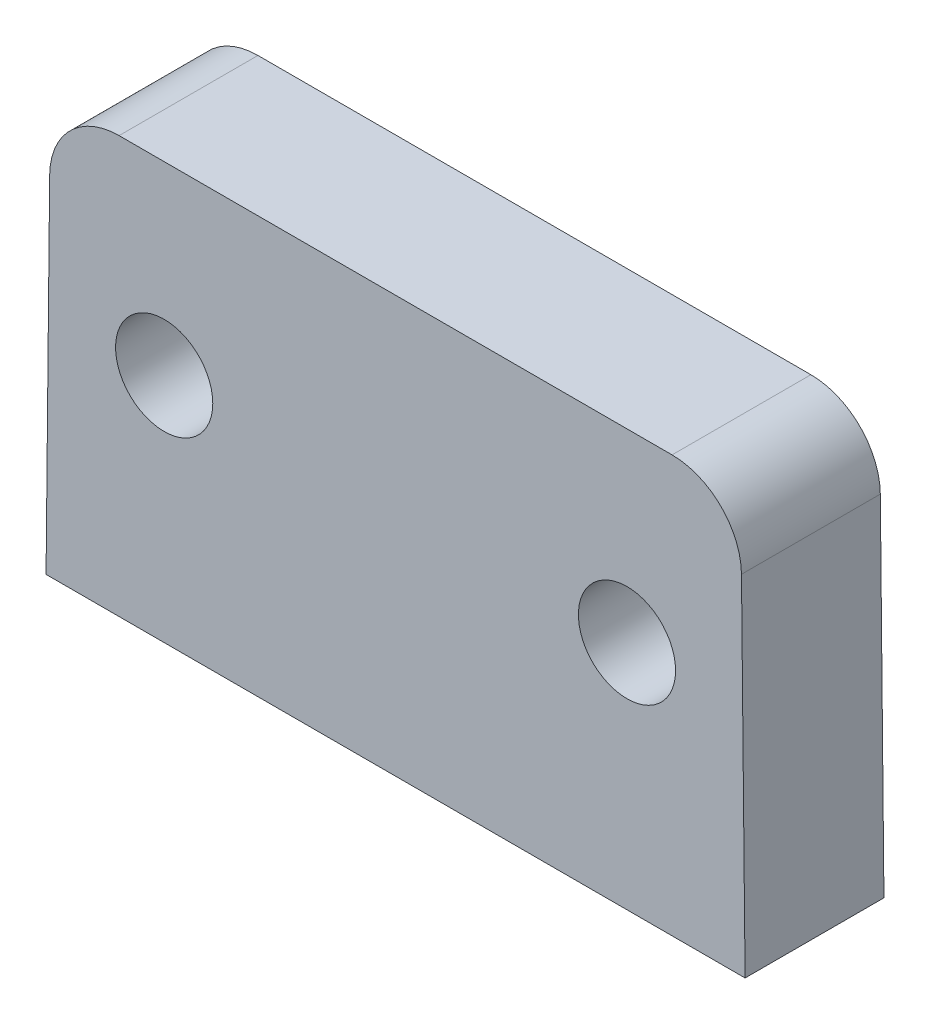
ISO-10303-21;
HEADER;
FILE_DESCRIPTION(('STEP AP214'),'2;1');
FILE_NAME('part.step','',(''),(''),'','','');
FILE_SCHEMA(('AUTOMOTIVE_DESIGN { 1 0 10303 214 1 1 1 1 }'));
ENDSEC;
DATA;
#1=APPLICATION_CONTEXT('core data for automotive mechanical design processes');
#2=APPLICATION_PROTOCOL_DEFINITION('international standard','automotive_design',2000,#1);
#3=PRODUCT_CONTEXT('',#1,'mechanical');
#4=PRODUCT('Part','Part','',(#3));
#5=PRODUCT_RELATED_PRODUCT_CATEGORY('part','',(#4));
#6=PRODUCT_DEFINITION_FORMATION('','',#4);
#7=PRODUCT_DEFINITION_CONTEXT('part definition',#1,'design');
#8=PRODUCT_DEFINITION('design','',#6,#7);
#9=PRODUCT_DEFINITION_SHAPE('','',#8);
#10=(LENGTH_UNIT() NAMED_UNIT(*) SI_UNIT(.MILLI.,.METRE.));
#11=(NAMED_UNIT(*) PLANE_ANGLE_UNIT() SI_UNIT($,.RADIAN.));
#12=(NAMED_UNIT(*) SI_UNIT($,.STERADIAN.) SOLID_ANGLE_UNIT());
#13=UNCERTAINTY_MEASURE_WITH_UNIT(LENGTH_MEASURE(1.E-05),#10,'distance_accuracy_value','');
#14=(GEOMETRIC_REPRESENTATION_CONTEXT(3) GLOBAL_UNCERTAINTY_ASSIGNED_CONTEXT((#13)) GLOBAL_UNIT_ASSIGNED_CONTEXT((#10,
#11,#12)) REPRESENTATION_CONTEXT('',''));
#15=CARTESIAN_POINT('',(0.,0.,0.));
#16=DIRECTION('',(0.,0.,1.));
#17=DIRECTION('',(1.,0.,0.));
#18=AXIS2_PLACEMENT_3D('',#15,#16,#17);
#19=CARTESIAN_POINT('',(3.15607429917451,15.,6.));
#20=DIRECTION('',(0.,0.,-1.));
#21=DIRECTION('',(-1.,0.,0.));
#22=AXIS2_PLACEMENT_3D('',#19,#20,#21);
#23=PLANE('',#22);
#24=DIRECTION('',(-0.0103935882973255,-0.999945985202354,0.));
#25=VECTOR('',#24,1.);
#26=CARTESIAN_POINT('',(0.,0.,6.));
#27=LINE('',#26,#25);
#28=CARTESIAN_POINT('',(0.156236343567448,15.031180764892,6.));
#29=VERTEX_POINT('',#28);
#30=CARTESIAN_POINT('',(0.,0.,6.));
#31=VERTEX_POINT('',#30);
#32=EDGE_CURVE('E130',#29,#31,#27,.T.);
#33=ORIENTED_EDGE('',*,*,#32,.T.);
#34=DIRECTION('',(1.,0.,0.));
#35=VECTOR('',#34,1.);
#36=CARTESIAN_POINT('',(0.,0.,6.));
#37=LINE('',#36,#35);
#38=CARTESIAN_POINT('',(30.2084231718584,0.,6.));
#39=VERTEX_POINT('',#38);
#40=EDGE_CURVE('E88',#31,#39,#37,.T.);
#41=ORIENTED_EDGE('',*,*,#40,.T.);
#42=DIRECTION('',(-0.0103935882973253,0.999945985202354,0.));
#43=VECTOR('',#42,1.);
#44=CARTESIAN_POINT('',(30.2084231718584,0.,6.));
#45=LINE('',#44,#43);
#46=CARTESIAN_POINT('',(30.052186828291,15.031180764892,6.));
#47=VERTEX_POINT('',#46);
#48=EDGE_CURVE('E101',#39,#47,#45,.T.);
#49=ORIENTED_EDGE('',*,*,#48,.T.);
#50=CARTESIAN_POINT('',(27.0523488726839,15.,6.));
#51=DIRECTION('',(0.,0.,1.));
#52=DIRECTION('',(1.,0.,0.));
#53=AXIS2_PLACEMENT_3D('',#50,#51,#52);
#54=CIRCLE('',#53,3.);
#55=CARTESIAN_POINT('',(27.0523488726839,18.,6.));
#56=VERTEX_POINT('',#55);
#57=EDGE_CURVE('E95',#47,#56,#54,.T.);
#58=ORIENTED_EDGE('',*,*,#57,.T.);
#59=DIRECTION('',(-1.,0.,0.));
#60=VECTOR('',#59,1.);
#61=CARTESIAN_POINT('',(3.15607429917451,18.,6.));
#62=LINE('',#61,#60);
#63=CARTESIAN_POINT('',(3.15607429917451,18.,6.));
#64=VERTEX_POINT('',#63);
#65=EDGE_CURVE('E99',#56,#64,#62,.T.);
#66=ORIENTED_EDGE('',*,*,#65,.T.);
#67=CARTESIAN_POINT('',(3.15607429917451,15.,6.));
#68=DIRECTION('',(0.,0.,1.));
#69=DIRECTION('',(-1.,0.,0.));
#70=AXIS2_PLACEMENT_3D('',#67,#68,#69);
#71=CIRCLE('',#70,3.);
#72=EDGE_CURVE('E51',#64,#29,#71,.T.);
#73=ORIENTED_EDGE('',*,*,#72,.T.);
#74=EDGE_LOOP('',(#33,#41,#49,#58,#66,#73));
#75=FACE_BOUND('',#74,.T.);
#76=CARTESIAN_POINT('',(5.10421158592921,10.,6.));
#77=DIRECTION('',(0.,0.,1.));
#78=DIRECTION('',(1.,0.,0.));
#79=AXIS2_PLACEMENT_3D('',#76,#77,#78);
#80=CIRCLE('',#79,2.1);
#81=CARTESIAN_POINT('',(7.20421158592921,10.,6.));
#82=VERTEX_POINT('',#81);
#83=EDGE_CURVE('E123',#82,#82,#80,.T.);
#84=ORIENTED_EDGE('',*,*,#83,.F.);
#85=EDGE_LOOP('',(#84));
#86=FACE_BOUND('',#85,.T.);
#87=CARTESIAN_POINT('',(25.1042115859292,10.,6.));
#88=DIRECTION('',(0.,0.,1.));
#89=DIRECTION('',(1.,0.,0.));
#90=AXIS2_PLACEMENT_3D('',#87,#88,#89);
#91=CIRCLE('',#90,2.1);
#92=CARTESIAN_POINT('',(27.2042115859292,10.,6.));
#93=VERTEX_POINT('',#92);
#94=EDGE_CURVE('E171',#93,#93,#91,.T.);
#95=ORIENTED_EDGE('',*,*,#94,.F.);
#96=EDGE_LOOP('',(#95));
#97=FACE_BOUND('',#96,.T.);
#98=ADVANCED_FACE('F34',(#75,#86,#97),#23,.F.);
#99=CARTESIAN_POINT('',(3.15607429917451,15.,0.));
#100=DIRECTION('',(0.,0.,-1.));
#101=DIRECTION('',(-1.,0.,0.));
#102=AXIS2_PLACEMENT_3D('',#99,#100,#101);
#103=PLANE('',#102);
#104=CARTESIAN_POINT('',(5.10421158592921,10.,0.));
#105=DIRECTION('',(0.,0.,1.));
#106=DIRECTION('',(1.,0.,0.));
#107=AXIS2_PLACEMENT_3D('',#104,#105,#106);
#108=CIRCLE('',#107,2.1);
#109=CARTESIAN_POINT('',(7.20421158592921,10.,0.));
#110=VERTEX_POINT('',#109);
#111=EDGE_CURVE('E176',#110,#110,#108,.T.);
#112=ORIENTED_EDGE('',*,*,#111,.T.);
#113=EDGE_LOOP('',(#112));
#114=FACE_BOUND('',#113,.T.);
#115=DIRECTION('',(-0.0103935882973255,-0.999945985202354,0.));
#116=VECTOR('',#115,1.);
#117=CARTESIAN_POINT('',(0.,0.,0.));
#118=LINE('',#117,#116);
#119=CARTESIAN_POINT('',(0.156236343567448,15.031180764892,0.));
#120=VERTEX_POINT('',#119);
#121=CARTESIAN_POINT('',(0.,0.,0.));
#122=VERTEX_POINT('',#121);
#123=EDGE_CURVE('E119',#120,#122,#118,.T.);
#124=ORIENTED_EDGE('',*,*,#123,.F.);
#125=CARTESIAN_POINT('',(3.15607429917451,15.,0.));
#126=DIRECTION('',(0.,0.,1.));
#127=DIRECTION('',(-1.,0.,0.));
#128=AXIS2_PLACEMENT_3D('',#125,#126,#127);
#129=CIRCLE('',#128,3.);
#130=CARTESIAN_POINT('',(3.15607429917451,18.,0.));
#131=VERTEX_POINT('',#130);
#132=EDGE_CURVE('E80',#131,#120,#129,.T.);
#133=ORIENTED_EDGE('',*,*,#132,.F.);
#134=DIRECTION('',(-1.,0.,0.));
#135=VECTOR('',#134,1.);
#136=CARTESIAN_POINT('',(3.15607429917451,18.,0.));
#137=LINE('',#136,#135);
#138=CARTESIAN_POINT('',(27.0523488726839,18.,0.));
#139=VERTEX_POINT('',#138);
#140=EDGE_CURVE('E74',#139,#131,#137,.T.);
#141=ORIENTED_EDGE('',*,*,#140,.F.);
#142=CARTESIAN_POINT('',(27.0523488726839,15.,0.));
#143=DIRECTION('',(0.,0.,1.));
#144=DIRECTION('',(1.,0.,0.));
#145=AXIS2_PLACEMENT_3D('',#142,#143,#144);
#146=CIRCLE('',#145,3.);
#147=CARTESIAN_POINT('',(30.052186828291,15.031180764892,0.));
#148=VERTEX_POINT('',#147);
#149=EDGE_CURVE('E109',#148,#139,#146,.T.);
#150=ORIENTED_EDGE('',*,*,#149,.F.);
#151=DIRECTION('',(-0.0103935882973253,0.999945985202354,0.));
#152=VECTOR('',#151,1.);
#153=CARTESIAN_POINT('',(30.2084231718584,0.,0.));
#154=LINE('',#153,#152);
#155=CARTESIAN_POINT('',(30.2084231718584,0.,0.));
#156=VERTEX_POINT('',#155);
#157=EDGE_CURVE('E125',#156,#148,#154,.T.);
#158=ORIENTED_EDGE('',*,*,#157,.F.);
#159=DIRECTION('',(1.,0.,0.));
#160=VECTOR('',#159,1.);
#161=CARTESIAN_POINT('',(0.,0.,0.));
#162=LINE('',#161,#160);
#163=EDGE_CURVE('E122',#122,#156,#162,.T.);
#164=ORIENTED_EDGE('',*,*,#163,.F.);
#165=EDGE_LOOP('',(#124,#133,#141,#150,#158,#164));
#166=FACE_BOUND('',#165,.T.);
#167=CARTESIAN_POINT('',(25.1042115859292,10.,0.));
#168=DIRECTION('',(0.,0.,1.));
#169=DIRECTION('',(1.,0.,0.));
#170=AXIS2_PLACEMENT_3D('',#167,#168,#169);
#171=CIRCLE('',#170,2.1);
#172=CARTESIAN_POINT('',(27.2042115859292,10.,0.));
#173=VERTEX_POINT('',#172);
#174=EDGE_CURVE('E174',#173,#173,#171,.T.);
#175=ORIENTED_EDGE('',*,*,#174,.T.);
#176=EDGE_LOOP('',(#175));
#177=FACE_BOUND('',#176,.T.);
#178=ADVANCED_FACE('F139',(#114,#166,#177),#103,.T.);
#179=CARTESIAN_POINT('',(0.,0.,6.));
#180=DIRECTION('',(0.999945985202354,-0.0103935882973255,0.));
#181=DIRECTION('',(0.0103935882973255,0.999945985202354,0.));
#182=AXIS2_PLACEMENT_3D('',#179,#180,#181);
#183=PLANE('',#182);
#184=ORIENTED_EDGE('',*,*,#123,.T.);
#185=DIRECTION('',(0.,0.,-1.));
#186=VECTOR('',#185,1.);
#187=CARTESIAN_POINT('',(0.,0.,6.));
#188=LINE('',#187,#186);
#189=EDGE_CURVE('E11',#31,#122,#188,.T.);
#190=ORIENTED_EDGE('',*,*,#189,.F.);
#191=ORIENTED_EDGE('',*,*,#32,.F.);
#192=DIRECTION('',(0.,0.,-1.));
#193=VECTOR('',#192,1.);
#194=CARTESIAN_POINT('',(0.156236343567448,15.031180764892,6.));
#195=LINE('',#194,#193);
#196=EDGE_CURVE('E115',#29,#120,#195,.T.);
#197=ORIENTED_EDGE('',*,*,#196,.T.);
#198=EDGE_LOOP('',(#184,#190,#191,#197));
#199=FACE_BOUND('',#198,.T.);
#200=ADVANCED_FACE('F36',(#199),#183,.F.);
#201=CARTESIAN_POINT('',(0.,0.,6.));
#202=DIRECTION('',(0.,1.,0.));
#203=DIRECTION('',(-1.,0.,0.));
#204=AXIS2_PLACEMENT_3D('',#201,#202,#203);
#205=PLANE('',#204);
#206=ORIENTED_EDGE('',*,*,#163,.T.);
#207=DIRECTION('',(0.,0.,-1.));
#208=VECTOR('',#207,1.);
#209=CARTESIAN_POINT('',(30.2084231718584,0.,6.));
#210=LINE('',#209,#208);
#211=EDGE_CURVE('E43',#39,#156,#210,.T.);
#212=ORIENTED_EDGE('',*,*,#211,.F.);
#213=ORIENTED_EDGE('',*,*,#40,.F.);
#214=ORIENTED_EDGE('',*,*,#189,.T.);
#215=EDGE_LOOP('',(#206,#212,#213,#214));
#216=FACE_BOUND('',#215,.T.);
#217=ADVANCED_FACE('F219',(#216),#205,.F.);
#218=CARTESIAN_POINT('',(30.2084231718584,0.,6.));
#219=DIRECTION('',(-0.999945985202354,-0.0103935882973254,0.));
#220=DIRECTION('',(0.0103935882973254,-0.999945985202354,0.));
#221=AXIS2_PLACEMENT_3D('',#218,#219,#220);
#222=PLANE('',#221);
#223=ORIENTED_EDGE('',*,*,#157,.T.);
#224=DIRECTION('',(0.,0.,-1.));
#225=VECTOR('',#224,1.);
#226=CARTESIAN_POINT('',(30.052186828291,15.031180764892,6.));
#227=LINE('',#226,#225);
#228=EDGE_CURVE('E110',#47,#148,#227,.T.);
#229=ORIENTED_EDGE('',*,*,#228,.F.);
#230=ORIENTED_EDGE('',*,*,#48,.F.);
#231=ORIENTED_EDGE('',*,*,#211,.T.);
#232=EDGE_LOOP('',(#223,#229,#230,#231));
#233=FACE_BOUND('',#232,.T.);
#234=ADVANCED_FACE('F136',(#233),#222,.F.);
#235=CARTESIAN_POINT('',(27.0523488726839,15.,6.));
#236=DIRECTION('',(0.,0.,-1.));
#237=DIRECTION('',(-1.,0.,0.));
#238=AXIS2_PLACEMENT_3D('',#235,#236,#237);
#239=CYLINDRICAL_SURFACE('',#238,3.);
#240=ORIENTED_EDGE('',*,*,#149,.T.);
#241=DIRECTION('',(0.,0.,-1.));
#242=VECTOR('',#241,1.);
#243=CARTESIAN_POINT('',(27.0523488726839,18.,6.));
#244=LINE('',#243,#242);
#245=EDGE_CURVE('E106',#56,#139,#244,.T.);
#246=ORIENTED_EDGE('',*,*,#245,.F.);
#247=ORIENTED_EDGE('',*,*,#57,.F.);
#248=ORIENTED_EDGE('',*,*,#228,.T.);
#249=EDGE_LOOP('',(#240,#246,#247,#248));
#250=FACE_BOUND('',#249,.T.);
#251=ADVANCED_FACE('F107',(#250),#239,.T.);
#252=CARTESIAN_POINT('',(3.15607429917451,18.,6.));
#253=DIRECTION('',(0.,-1.,0.));
#254=DIRECTION('',(0.,0.,-1.));
#255=AXIS2_PLACEMENT_3D('',#252,#253,#254);
#256=PLANE('',#255);
#257=ORIENTED_EDGE('',*,*,#140,.T.);
#258=DIRECTION('',(0.,0.,-1.));
#259=VECTOR('',#258,1.);
#260=CARTESIAN_POINT('',(3.15607429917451,18.,6.));
#261=LINE('',#260,#259);
#262=EDGE_CURVE('E111',#64,#131,#261,.T.);
#263=ORIENTED_EDGE('',*,*,#262,.F.);
#264=ORIENTED_EDGE('',*,*,#65,.F.);
#265=ORIENTED_EDGE('',*,*,#245,.T.);
#266=EDGE_LOOP('',(#257,#263,#264,#265));
#267=FACE_BOUND('',#266,.T.);
#268=ADVANCED_FACE('F113',(#267),#256,.F.);
#269=CARTESIAN_POINT('',(3.15607429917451,15.,6.));
#270=DIRECTION('',(0.,0.,-1.));
#271=DIRECTION('',(-1.,0.,0.));
#272=AXIS2_PLACEMENT_3D('',#269,#270,#271);
#273=CYLINDRICAL_SURFACE('',#272,3.);
#274=ORIENTED_EDGE('',*,*,#132,.T.);
#275=ORIENTED_EDGE('',*,*,#196,.F.);
#276=ORIENTED_EDGE('',*,*,#72,.F.);
#277=ORIENTED_EDGE('',*,*,#262,.T.);
#278=EDGE_LOOP('',(#274,#275,#276,#277));
#279=FACE_BOUND('',#278,.T.);
#280=ADVANCED_FACE('F144',(#279),#273,.T.);
#281=CARTESIAN_POINT('',(5.10421158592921,10.,6.));
#282=DIRECTION('',(0.,0.,-1.));
#283=DIRECTION('',(-1.,0.,0.));
#284=AXIS2_PLACEMENT_3D('',#281,#282,#283);
#285=CYLINDRICAL_SURFACE('',#284,2.1);
#286=ORIENTED_EDGE('',*,*,#83,.T.);
#287=EDGE_LOOP('',(#286));
#288=FACE_BOUND('',#287,.T.);
#289=ORIENTED_EDGE('',*,*,#111,.F.);
#290=EDGE_LOOP('',(#289));
#291=FACE_BOUND('',#290,.T.);
#292=ADVANCED_FACE('F146',(#288,#291),#285,.F.);
#293=CARTESIAN_POINT('',(25.1042115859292,10.,6.));
#294=DIRECTION('',(0.,0.,-1.));
#295=DIRECTION('',(-1.,0.,0.));
#296=AXIS2_PLACEMENT_3D('',#293,#294,#295);
#297=CYLINDRICAL_SURFACE('',#296,2.1);
#298=ORIENTED_EDGE('',*,*,#94,.T.);
#299=EDGE_LOOP('',(#298));
#300=FACE_BOUND('',#299,.T.);
#301=ORIENTED_EDGE('',*,*,#174,.F.);
#302=EDGE_LOOP('',(#301));
#303=FACE_BOUND('',#302,.T.);
#304=ADVANCED_FACE('F152',(#300,#303),#297,.F.);
#305=CLOSED_SHELL('',(#98,#178,#200,#217,#234,#251,#268,#280,#292,#304));
#306=MANIFOLD_SOLID_BREP('B2',#305);
#307=ADVANCED_BREP_SHAPE_REPRESENTATION('',(#18,#306),#14);
#308=SHAPE_DEFINITION_REPRESENTATION(#9,#307);
ENDSEC;
END-ISO-10303-21;
